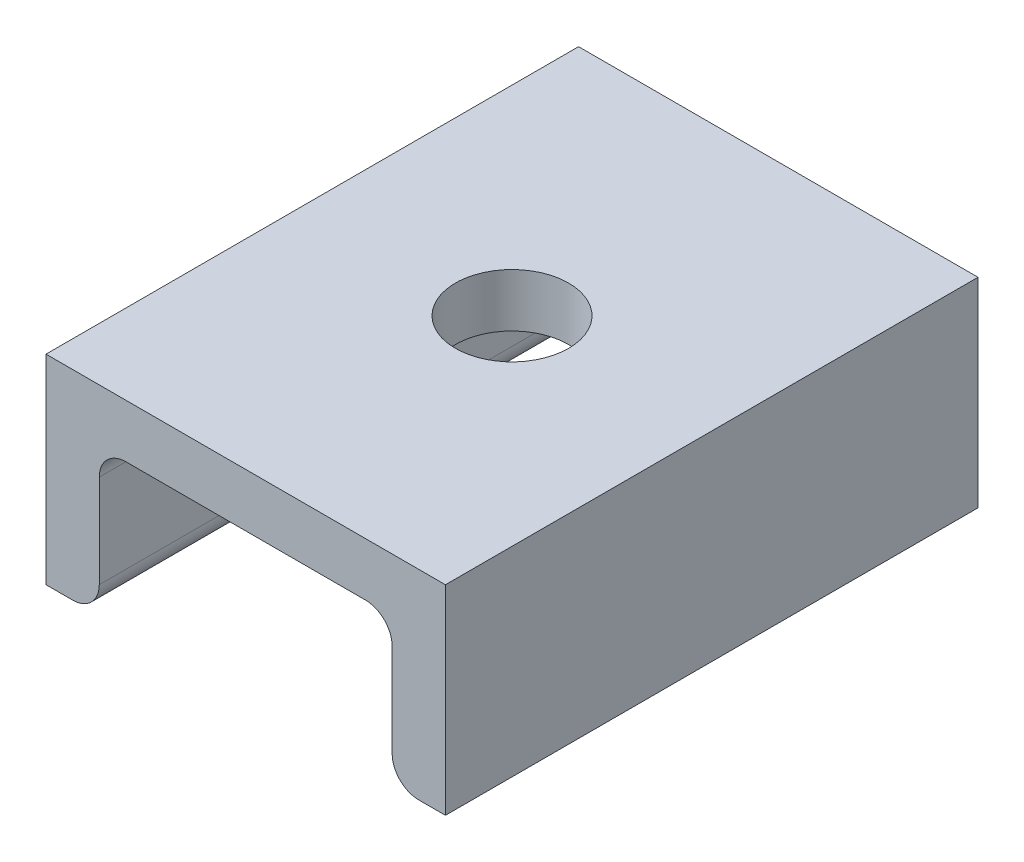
ISO-10303-21;
HEADER;
FILE_DESCRIPTION(('STEP AP214'),'2;1');
FILE_NAME('part.step','',(''),(''),'','','');
FILE_SCHEMA(('AUTOMOTIVE_DESIGN { 1 0 10303 214 1 1 1 1 }'));
ENDSEC;
DATA;
#1=APPLICATION_CONTEXT('core data for automotive mechanical design processes');
#2=APPLICATION_PROTOCOL_DEFINITION('international standard','automotive_design',2000,#1);
#3=PRODUCT_CONTEXT('',#1,'mechanical');
#4=PRODUCT('Part','Part','',(#3));
#5=PRODUCT_RELATED_PRODUCT_CATEGORY('part','',(#4));
#6=PRODUCT_DEFINITION_FORMATION('','',#4);
#7=PRODUCT_DEFINITION_CONTEXT('part definition',#1,'design');
#8=PRODUCT_DEFINITION('design','',#6,#7);
#9=PRODUCT_DEFINITION_SHAPE('','',#8);
#10=(LENGTH_UNIT() NAMED_UNIT(*) SI_UNIT(.MILLI.,.METRE.));
#11=(NAMED_UNIT(*) PLANE_ANGLE_UNIT() SI_UNIT($,.RADIAN.));
#12=(NAMED_UNIT(*) SI_UNIT($,.STERADIAN.) SOLID_ANGLE_UNIT());
#13=UNCERTAINTY_MEASURE_WITH_UNIT(LENGTH_MEASURE(1.E-05),#10,'distance_accuracy_value','');
#14=(GEOMETRIC_REPRESENTATION_CONTEXT(3) GLOBAL_UNCERTAINTY_ASSIGNED_CONTEXT((#13)) GLOBAL_UNIT_ASSIGNED_CONTEXT((#10,
#11,#12)) REPRESENTATION_CONTEXT('',''));
#15=CARTESIAN_POINT('',(0.,0.,0.));
#16=DIRECTION('',(0.,0.,1.));
#17=DIRECTION('',(1.,0.,0.));
#18=AXIS2_PLACEMENT_3D('',#15,#16,#17);
#19=CARTESIAN_POINT('',(13.,-15.,40.));
#20=DIRECTION('',(0.,1.,0.));
#21=DIRECTION('',(0.,0.,1.));
#22=AXIS2_PLACEMENT_3D('',#19,#20,#21);
#23=PLANE('',#22);
#24=DIRECTION('',(1.,0.,0.));
#25=VECTOR('',#24,1.);
#26=CARTESIAN_POINT('',(13.,-15.,0.));
#27=LINE('',#26,#25);
#28=CARTESIAN_POINT('',(13.,-15.,0.));
#29=VERTEX_POINT('',#28);
#30=CARTESIAN_POINT('',(15.,-15.,0.));
#31=VERTEX_POINT('',#30);
#32=EDGE_CURVE('E155',#29,#31,#27,.T.);
#33=ORIENTED_EDGE('',*,*,#32,.T.);
#34=DIRECTION('',(0.,0.,-1.));
#35=VECTOR('',#34,1.);
#36=CARTESIAN_POINT('',(15.,-15.,40.));
#37=LINE('',#36,#35);
#38=CARTESIAN_POINT('',(15.,-15.,40.));
#39=VERTEX_POINT('',#38);
#40=EDGE_CURVE('E11',#39,#31,#37,.T.);
#41=ORIENTED_EDGE('',*,*,#40,.F.);
#42=DIRECTION('',(1.,0.,0.));
#43=VECTOR('',#42,1.);
#44=CARTESIAN_POINT('',(13.,-15.,40.));
#45=LINE('',#44,#43);
#46=CARTESIAN_POINT('',(13.,-15.,40.));
#47=VERTEX_POINT('',#46);
#48=EDGE_CURVE('E178',#47,#39,#45,.T.);
#49=ORIENTED_EDGE('',*,*,#48,.F.);
#50=DIRECTION('',(0.,0.,-1.));
#51=VECTOR('',#50,1.);
#52=CARTESIAN_POINT('',(13.,-15.,40.));
#53=LINE('',#52,#51);
#54=EDGE_CURVE('E151',#47,#29,#53,.T.);
#55=ORIENTED_EDGE('',*,*,#54,.T.);
#56=EDGE_LOOP('',(#33,#41,#49,#55));
#57=FACE_BOUND('',#56,.T.);
#58=ADVANCED_FACE('F35',(#57),#23,.F.);
#59=CARTESIAN_POINT('',(15.,-15.,40.));
#60=DIRECTION('',(-1.,0.,0.));
#61=DIRECTION('',(0.,-1.,0.));
#62=AXIS2_PLACEMENT_3D('',#59,#60,#61);
#63=PLANE('',#62);
#64=DIRECTION('',(0.,1.,0.));
#65=VECTOR('',#64,1.);
#66=CARTESIAN_POINT('',(15.,-15.,0.));
#67=LINE('',#66,#65);
#68=CARTESIAN_POINT('',(15.,0.,0.));
#69=VERTEX_POINT('',#68);
#70=EDGE_CURVE('E158',#31,#69,#67,.T.);
#71=ORIENTED_EDGE('',*,*,#70,.T.);
#72=DIRECTION('',(0.,0.,-1.));
#73=VECTOR('',#72,1.);
#74=CARTESIAN_POINT('',(15.,0.,40.));
#75=LINE('',#74,#73);
#76=CARTESIAN_POINT('',(15.,0.,40.));
#77=VERTEX_POINT('',#76);
#78=EDGE_CURVE('E43',#77,#69,#75,.T.);
#79=ORIENTED_EDGE('',*,*,#78,.F.);
#80=DIRECTION('',(0.,1.,0.));
#81=VECTOR('',#80,1.);
#82=CARTESIAN_POINT('',(15.,-15.,40.));
#83=LINE('',#82,#81);
#84=EDGE_CURVE('E106',#39,#77,#83,.T.);
#85=ORIENTED_EDGE('',*,*,#84,.F.);
#86=ORIENTED_EDGE('',*,*,#40,.T.);
#87=EDGE_LOOP('',(#71,#79,#85,#86));
#88=FACE_BOUND('',#87,.T.);
#89=ADVANCED_FACE('F256',(#88),#63,.F.);
#90=CARTESIAN_POINT('',(15.,0.,40.));
#91=DIRECTION('',(0.,-1.,0.));
#92=DIRECTION('',(1.,0.,0.));
#93=AXIS2_PLACEMENT_3D('',#90,#91,#92);
#94=PLANE('',#93);
#95=CARTESIAN_POINT('',(0.,0.,20.));
#96=DIRECTION('',(0.,-1.,0.));
#97=DIRECTION('',(1.,0.,0.));
#98=AXIS2_PLACEMENT_3D('',#95,#96,#97);
#99=CIRCLE('',#98,4.25);
#100=CARTESIAN_POINT('',(4.25,0.,20.));
#101=VERTEX_POINT('',#100);
#102=EDGE_CURVE('E159',#101,#101,#99,.T.);
#103=ORIENTED_EDGE('',*,*,#102,.T.);
#104=EDGE_LOOP('',(#103));
#105=FACE_BOUND('',#104,.T.);
#106=DIRECTION('',(-1.,0.,0.));
#107=VECTOR('',#106,1.);
#108=CARTESIAN_POINT('',(15.,0.,0.));
#109=LINE('',#108,#107);
#110=CARTESIAN_POINT('',(-15.,0.,0.));
#111=VERTEX_POINT('',#110);
#112=EDGE_CURVE('E161',#69,#111,#109,.T.);
#113=ORIENTED_EDGE('',*,*,#112,.T.);
#114=DIRECTION('',(0.,0.,-1.));
#115=VECTOR('',#114,1.);
#116=CARTESIAN_POINT('',(-15.,0.,40.));
#117=LINE('',#116,#115);
#118=CARTESIAN_POINT('',(-15.,0.,40.));
#119=VERTEX_POINT('',#118);
#120=EDGE_CURVE('E197',#119,#111,#117,.T.);
#121=ORIENTED_EDGE('',*,*,#120,.F.);
#122=DIRECTION('',(-1.,0.,0.));
#123=VECTOR('',#122,1.);
#124=CARTESIAN_POINT('',(15.,0.,40.));
#125=LINE('',#124,#123);
#126=EDGE_CURVE('E205',#77,#119,#125,.T.);
#127=ORIENTED_EDGE('',*,*,#126,.F.);
#128=ORIENTED_EDGE('',*,*,#78,.T.);
#129=EDGE_LOOP('',(#113,#121,#127,#128));
#130=FACE_BOUND('',#129,.T.);
#131=ADVANCED_FACE('F203',(#105,#130),#94,.F.);
#132=CARTESIAN_POINT('',(-15.,-15.,40.));
#133=DIRECTION('',(1.,0.,0.));
#134=DIRECTION('',(0.,1.,0.));
#135=AXIS2_PLACEMENT_3D('',#132,#133,#134);
#136=PLANE('',#135);
#137=DIRECTION('',(0.,-1.,0.));
#138=VECTOR('',#137,1.);
#139=CARTESIAN_POINT('',(-15.,-15.,0.));
#140=LINE('',#139,#138);
#141=CARTESIAN_POINT('',(-15.,-15.,0.));
#142=VERTEX_POINT('',#141);
#143=EDGE_CURVE('E163',#111,#142,#140,.T.);
#144=ORIENTED_EDGE('',*,*,#143,.T.);
#145=DIRECTION('',(0.,0.,-1.));
#146=VECTOR('',#145,1.);
#147=CARTESIAN_POINT('',(-15.,-15.,40.));
#148=LINE('',#147,#146);
#149=CARTESIAN_POINT('',(-15.,-15.,40.));
#150=VERTEX_POINT('',#149);
#151=EDGE_CURVE('E194',#150,#142,#148,.T.);
#152=ORIENTED_EDGE('',*,*,#151,.F.);
#153=DIRECTION('',(0.,-1.,0.));
#154=VECTOR('',#153,1.);
#155=CARTESIAN_POINT('',(-15.,-15.,40.));
#156=LINE('',#155,#154);
#157=EDGE_CURVE('E223',#119,#150,#156,.T.);
#158=ORIENTED_EDGE('',*,*,#157,.F.);
#159=ORIENTED_EDGE('',*,*,#120,.T.);
#160=EDGE_LOOP('',(#144,#152,#158,#159));
#161=FACE_BOUND('',#160,.T.);
#162=ADVANCED_FACE('F214',(#161),#136,.F.);
#163=CARTESIAN_POINT('',(-13.,-15.,40.));
#164=DIRECTION('',(0.,1.,0.));
#165=DIRECTION('',(0.,0.,1.));
#166=AXIS2_PLACEMENT_3D('',#163,#164,#165);
#167=PLANE('',#166);
#168=DIRECTION('',(1.,0.,0.));
#169=VECTOR('',#168,1.);
#170=CARTESIAN_POINT('',(-13.,-15.,0.));
#171=LINE('',#170,#169);
#172=CARTESIAN_POINT('',(-13.,-15.,0.));
#173=VERTEX_POINT('',#172);
#174=EDGE_CURVE('E165',#142,#173,#171,.T.);
#175=ORIENTED_EDGE('',*,*,#174,.T.);
#176=DIRECTION('',(0.,0.,-1.));
#177=VECTOR('',#176,1.);
#178=CARTESIAN_POINT('',(-13.,-15.,40.));
#179=LINE('',#178,#177);
#180=CARTESIAN_POINT('',(-13.,-15.,40.));
#181=VERTEX_POINT('',#180);
#182=EDGE_CURVE('E191',#181,#173,#179,.T.);
#183=ORIENTED_EDGE('',*,*,#182,.F.);
#184=DIRECTION('',(1.,0.,0.));
#185=VECTOR('',#184,1.);
#186=CARTESIAN_POINT('',(-13.,-15.,40.));
#187=LINE('',#186,#185);
#188=EDGE_CURVE('E220',#150,#181,#187,.T.);
#189=ORIENTED_EDGE('',*,*,#188,.F.);
#190=ORIENTED_EDGE('',*,*,#151,.T.);
#191=EDGE_LOOP('',(#175,#183,#189,#190));
#192=FACE_BOUND('',#191,.T.);
#193=ADVANCED_FACE('F218',(#192),#167,.F.);
#194=CARTESIAN_POINT('',(-13.,-13.,40.));
#195=DIRECTION('',(0.,0.,-1.));
#196=DIRECTION('',(-1.,0.,0.));
#197=AXIS2_PLACEMENT_3D('',#194,#195,#196);
#198=CYLINDRICAL_SURFACE('',#197,2.);
#199=CARTESIAN_POINT('',(-13.,-13.,0.));
#200=DIRECTION('',(0.,0.,1.));
#201=DIRECTION('',(-1.,0.,0.));
#202=AXIS2_PLACEMENT_3D('',#199,#200,#201);
#203=CIRCLE('',#202,2.);
#204=CARTESIAN_POINT('',(-11.,-13.,0.));
#205=VERTEX_POINT('',#204);
#206=EDGE_CURVE('E167',#173,#205,#203,.T.);
#207=ORIENTED_EDGE('',*,*,#206,.T.);
#208=DIRECTION('',(0.,0.,-1.));
#209=VECTOR('',#208,1.);
#210=CARTESIAN_POINT('',(-11.,-13.,40.));
#211=LINE('',#210,#209);
#212=CARTESIAN_POINT('',(-11.,-13.,40.));
#213=VERTEX_POINT('',#212);
#214=EDGE_CURVE('E188',#213,#205,#211,.T.);
#215=ORIENTED_EDGE('',*,*,#214,.F.);
#216=CARTESIAN_POINT('',(-13.,-13.,40.));
#217=DIRECTION('',(0.,0.,1.));
#218=DIRECTION('',(-1.,0.,0.));
#219=AXIS2_PLACEMENT_3D('',#216,#217,#218);
#220=CIRCLE('',#219,2.);
#221=EDGE_CURVE('E222',#181,#213,#220,.T.);
#222=ORIENTED_EDGE('',*,*,#221,.F.);
#223=ORIENTED_EDGE('',*,*,#182,.T.);
#224=EDGE_LOOP('',(#207,#215,#222,#223));
#225=FACE_BOUND('',#224,.T.);
#226=ADVANCED_FACE('F270',(#225),#198,.T.);
#227=CARTESIAN_POINT('',(-11.,-6.,40.));
#228=DIRECTION('',(-1.,0.,0.));
#229=DIRECTION('',(0.,0.,1.));
#230=AXIS2_PLACEMENT_3D('',#227,#228,#229);
#231=PLANE('',#230);
#232=DIRECTION('',(0.,1.,0.));
#233=VECTOR('',#232,1.);
#234=CARTESIAN_POINT('',(-11.,-6.,0.));
#235=LINE('',#234,#233);
#236=CARTESIAN_POINT('',(-11.,-6.,0.));
#237=VERTEX_POINT('',#236);
#238=EDGE_CURVE('E169',#205,#237,#235,.T.);
#239=ORIENTED_EDGE('',*,*,#238,.T.);
#240=DIRECTION('',(0.,0.,-1.));
#241=VECTOR('',#240,1.);
#242=CARTESIAN_POINT('',(-11.,-6.,40.));
#243=LINE('',#242,#241);
#244=CARTESIAN_POINT('',(-11.,-6.,40.));
#245=VERTEX_POINT('',#244);
#246=EDGE_CURVE('E185',#245,#237,#243,.T.);
#247=ORIENTED_EDGE('',*,*,#246,.F.);
#248=DIRECTION('',(0.,1.,0.));
#249=VECTOR('',#248,1.);
#250=CARTESIAN_POINT('',(-11.,-6.,40.));
#251=LINE('',#250,#249);
#252=EDGE_CURVE('E225',#213,#245,#251,.T.);
#253=ORIENTED_EDGE('',*,*,#252,.F.);
#254=ORIENTED_EDGE('',*,*,#214,.T.);
#255=EDGE_LOOP('',(#239,#247,#253,#254));
#256=FACE_BOUND('',#255,.T.);
#257=ADVANCED_FACE('F273',(#256),#231,.F.);
#258=CARTESIAN_POINT('',(-9.,-6.,40.));
#259=DIRECTION('',(0.,0.,-1.));
#260=DIRECTION('',(-1.,0.,0.));
#261=AXIS2_PLACEMENT_3D('',#258,#259,#260);
#262=CYLINDRICAL_SURFACE('',#261,2.);
#263=CARTESIAN_POINT('',(-9.,-6.,0.));
#264=DIRECTION('',(0.,0.,-1.));
#265=DIRECTION('',(1.,0.,0.));
#266=AXIS2_PLACEMENT_3D('',#263,#264,#265);
#267=CIRCLE('',#266,2.);
#268=CARTESIAN_POINT('',(-9.,-4.,0.));
#269=VERTEX_POINT('',#268);
#270=EDGE_CURVE('E171',#237,#269,#267,.T.);
#271=ORIENTED_EDGE('',*,*,#270,.T.);
#272=DIRECTION('',(0.,0.,-1.));
#273=VECTOR('',#272,1.);
#274=CARTESIAN_POINT('',(-9.,-4.,40.));
#275=LINE('',#274,#273);
#276=CARTESIAN_POINT('',(-9.,-4.,40.));
#277=VERTEX_POINT('',#276);
#278=EDGE_CURVE('E182',#277,#269,#275,.T.);
#279=ORIENTED_EDGE('',*,*,#278,.F.);
#280=CARTESIAN_POINT('',(-9.,-6.,40.));
#281=DIRECTION('',(0.,0.,-1.));
#282=DIRECTION('',(1.,0.,0.));
#283=AXIS2_PLACEMENT_3D('',#280,#281,#282);
#284=CIRCLE('',#283,2.);
#285=EDGE_CURVE('E231',#245,#277,#284,.T.);
#286=ORIENTED_EDGE('',*,*,#285,.F.);
#287=ORIENTED_EDGE('',*,*,#246,.T.);
#288=EDGE_LOOP('',(#271,#279,#286,#287));
#289=FACE_BOUND('',#288,.T.);
#290=ADVANCED_FACE('F237',(#289),#262,.F.);
#291=CARTESIAN_POINT('',(-9.,-4.,40.));
#292=DIRECTION('',(0.,1.,0.));
#293=DIRECTION('',(-1.,0.,0.));
#294=AXIS2_PLACEMENT_3D('',#291,#292,#293);
#295=PLANE('',#294);
#296=CARTESIAN_POINT('',(0.,-4.,20.));
#297=DIRECTION('',(0.,-1.,0.));
#298=DIRECTION('',(1.,0.,0.));
#299=AXIS2_PLACEMENT_3D('',#296,#297,#298);
#300=CIRCLE('',#299,4.25);
#301=CARTESIAN_POINT('',(4.25,-4.,20.));
#302=VERTEX_POINT('',#301);
#303=EDGE_CURVE('E342',#302,#302,#300,.T.);
#304=ORIENTED_EDGE('',*,*,#303,.F.);
#305=EDGE_LOOP('',(#304));
#306=FACE_BOUND('',#305,.T.);
#307=DIRECTION('',(1.,0.,0.));
#308=VECTOR('',#307,1.);
#309=CARTESIAN_POINT('',(-9.,-4.,0.));
#310=LINE('',#309,#308);
#311=CARTESIAN_POINT('',(9.,-4.,0.));
#312=VERTEX_POINT('',#311);
#313=EDGE_CURVE('E173',#269,#312,#310,.T.);
#314=ORIENTED_EDGE('',*,*,#313,.T.);
#315=DIRECTION('',(0.,0.,-1.));
#316=VECTOR('',#315,1.);
#317=CARTESIAN_POINT('',(9.,-4.,40.));
#318=LINE('',#317,#316);
#319=CARTESIAN_POINT('',(9.,-4.,40.));
#320=VERTEX_POINT('',#319);
#321=EDGE_CURVE('E146',#320,#312,#318,.T.);
#322=ORIENTED_EDGE('',*,*,#321,.F.);
#323=DIRECTION('',(1.,0.,0.));
#324=VECTOR('',#323,1.);
#325=CARTESIAN_POINT('',(-9.,-4.,40.));
#326=LINE('',#325,#324);
#327=EDGE_CURVE('E137',#277,#320,#326,.T.);
#328=ORIENTED_EDGE('',*,*,#327,.F.);
#329=ORIENTED_EDGE('',*,*,#278,.T.);
#330=EDGE_LOOP('',(#314,#322,#328,#329));
#331=FACE_BOUND('',#330,.T.);
#332=ADVANCED_FACE('F241',(#306,#331),#295,.F.);
#333=CARTESIAN_POINT('',(9.,-6.,40.));
#334=DIRECTION('',(0.,0.,-1.));
#335=DIRECTION('',(-1.,0.,0.));
#336=AXIS2_PLACEMENT_3D('',#333,#334,#335);
#337=CYLINDRICAL_SURFACE('',#336,2.);
#338=CARTESIAN_POINT('',(9.,-6.,0.));
#339=DIRECTION('',(0.,0.,-1.));
#340=DIRECTION('',(-1.,0.,0.));
#341=AXIS2_PLACEMENT_3D('',#338,#339,#340);
#342=CIRCLE('',#341,2.);
#343=CARTESIAN_POINT('',(11.,-6.,0.));
#344=VERTEX_POINT('',#343);
#345=EDGE_CURVE('E145',#312,#344,#342,.T.);
#346=ORIENTED_EDGE('',*,*,#345,.T.);
#347=DIRECTION('',(0.,0.,-1.));
#348=VECTOR('',#347,1.);
#349=CARTESIAN_POINT('',(11.,-6.,40.));
#350=LINE('',#349,#348);
#351=CARTESIAN_POINT('',(11.,-6.,40.));
#352=VERTEX_POINT('',#351);
#353=EDGE_CURVE('E142',#352,#344,#350,.T.);
#354=ORIENTED_EDGE('',*,*,#353,.F.);
#355=CARTESIAN_POINT('',(9.,-6.,40.));
#356=DIRECTION('',(0.,0.,-1.));
#357=DIRECTION('',(-1.,0.,0.));
#358=AXIS2_PLACEMENT_3D('',#355,#356,#357);
#359=CIRCLE('',#358,2.);
#360=EDGE_CURVE('E131',#320,#352,#359,.T.);
#361=ORIENTED_EDGE('',*,*,#360,.F.);
#362=ORIENTED_EDGE('',*,*,#321,.T.);
#363=EDGE_LOOP('',(#346,#354,#361,#362));
#364=FACE_BOUND('',#363,.T.);
#365=ADVANCED_FACE('F143',(#364),#337,.F.);
#366=CARTESIAN_POINT('',(11.,-6.,40.));
#367=DIRECTION('',(1.,0.,0.));
#368=DIRECTION('',(0.,0.,-1.));
#369=AXIS2_PLACEMENT_3D('',#366,#367,#368);
#370=PLANE('',#369);
#371=DIRECTION('',(0.,-1.,0.));
#372=VECTOR('',#371,1.);
#373=CARTESIAN_POINT('',(11.,-6.,0.));
#374=LINE('',#373,#372);
#375=CARTESIAN_POINT('',(11.,-13.,0.));
#376=VERTEX_POINT('',#375);
#377=EDGE_CURVE('E92',#344,#376,#374,.T.);
#378=ORIENTED_EDGE('',*,*,#377,.T.);
#379=DIRECTION('',(0.,0.,-1.));
#380=VECTOR('',#379,1.);
#381=CARTESIAN_POINT('',(11.,-13.,40.));
#382=LINE('',#381,#380);
#383=CARTESIAN_POINT('',(11.,-13.,40.));
#384=VERTEX_POINT('',#383);
#385=EDGE_CURVE('E147',#384,#376,#382,.T.);
#386=ORIENTED_EDGE('',*,*,#385,.F.);
#387=DIRECTION('',(0.,-1.,0.));
#388=VECTOR('',#387,1.);
#389=CARTESIAN_POINT('',(11.,-6.,40.));
#390=LINE('',#389,#388);
#391=EDGE_CURVE('E135',#352,#384,#390,.T.);
#392=ORIENTED_EDGE('',*,*,#391,.F.);
#393=ORIENTED_EDGE('',*,*,#353,.T.);
#394=EDGE_LOOP('',(#378,#386,#392,#393));
#395=FACE_BOUND('',#394,.T.);
#396=ADVANCED_FACE('F149',(#395),#370,.F.);
#397=CARTESIAN_POINT('',(13.,-13.,40.));
#398=DIRECTION('',(0.,0.,-1.));
#399=DIRECTION('',(-1.,0.,0.));
#400=AXIS2_PLACEMENT_3D('',#397,#398,#399);
#401=CYLINDRICAL_SURFACE('',#400,2.);
#402=CARTESIAN_POINT('',(13.,-13.,0.));
#403=DIRECTION('',(0.,0.,1.));
#404=DIRECTION('',(1.,0.,0.));
#405=AXIS2_PLACEMENT_3D('',#402,#403,#404);
#406=CIRCLE('',#405,2.);
#407=EDGE_CURVE('E98',#376,#29,#406,.T.);
#408=ORIENTED_EDGE('',*,*,#407,.T.);
#409=ORIENTED_EDGE('',*,*,#54,.F.);
#410=CARTESIAN_POINT('',(13.,-13.,40.));
#411=DIRECTION('',(0.,0.,1.));
#412=DIRECTION('',(1.,0.,0.));
#413=AXIS2_PLACEMENT_3D('',#410,#411,#412);
#414=CIRCLE('',#413,2.);
#415=EDGE_CURVE('E51',#384,#47,#414,.T.);
#416=ORIENTED_EDGE('',*,*,#415,.F.);
#417=ORIENTED_EDGE('',*,*,#385,.T.);
#418=EDGE_LOOP('',(#408,#409,#416,#417));
#419=FACE_BOUND('',#418,.T.);
#420=ADVANCED_FACE('F245',(#419),#401,.T.);
#421=CARTESIAN_POINT('',(-13.,-13.,40.));
#422=DIRECTION('',(0.,0.,-1.));
#423=DIRECTION('',(-1.,0.,0.));
#424=AXIS2_PLACEMENT_3D('',#421,#422,#423);
#425=PLANE('',#424);
#426=ORIENTED_EDGE('',*,*,#48,.T.);
#427=ORIENTED_EDGE('',*,*,#84,.T.);
#428=ORIENTED_EDGE('',*,*,#126,.T.);
#429=ORIENTED_EDGE('',*,*,#157,.T.);
#430=ORIENTED_EDGE('',*,*,#188,.T.);
#431=ORIENTED_EDGE('',*,*,#221,.T.);
#432=ORIENTED_EDGE('',*,*,#252,.T.);
#433=ORIENTED_EDGE('',*,*,#285,.T.);
#434=ORIENTED_EDGE('',*,*,#327,.T.);
#435=ORIENTED_EDGE('',*,*,#360,.T.);
#436=ORIENTED_EDGE('',*,*,#391,.T.);
#437=ORIENTED_EDGE('',*,*,#415,.T.);
#438=EDGE_LOOP('',(#426,#427,#428,#429,#430,#431,#432,#433,#434,#435,#436,#437));
#439=FACE_BOUND('',#438,.T.);
#440=ADVANCED_FACE('F133',(#439),#425,.F.);
#441=CARTESIAN_POINT('',(-13.,-13.,0.));
#442=DIRECTION('',(0.,0.,-1.));
#443=DIRECTION('',(-1.,0.,0.));
#444=AXIS2_PLACEMENT_3D('',#441,#442,#443);
#445=PLANE('',#444);
#446=ORIENTED_EDGE('',*,*,#32,.F.);
#447=ORIENTED_EDGE('',*,*,#407,.F.);
#448=ORIENTED_EDGE('',*,*,#377,.F.);
#449=ORIENTED_EDGE('',*,*,#345,.F.);
#450=ORIENTED_EDGE('',*,*,#313,.F.);
#451=ORIENTED_EDGE('',*,*,#270,.F.);
#452=ORIENTED_EDGE('',*,*,#238,.F.);
#453=ORIENTED_EDGE('',*,*,#206,.F.);
#454=ORIENTED_EDGE('',*,*,#174,.F.);
#455=ORIENTED_EDGE('',*,*,#143,.F.);
#456=ORIENTED_EDGE('',*,*,#112,.F.);
#457=ORIENTED_EDGE('',*,*,#70,.F.);
#458=EDGE_LOOP('',(#446,#447,#448,#449,#450,#451,#452,#453,#454,#455,#456,#457));
#459=FACE_BOUND('',#458,.T.);
#460=ADVANCED_FACE('F209',(#459),#445,.T.);
#461=CARTESIAN_POINT('',(0.,0.,20.));
#462=DIRECTION('',(0.,-1.,0.));
#463=DIRECTION('',(1.,0.,0.));
#464=AXIS2_PLACEMENT_3D('',#461,#462,#463);
#465=CYLINDRICAL_SURFACE('',#464,4.25);
#466=ORIENTED_EDGE('',*,*,#102,.F.);
#467=EDGE_LOOP('',(#466));
#468=FACE_BOUND('',#467,.T.);
#469=ORIENTED_EDGE('',*,*,#303,.T.);
#470=EDGE_LOOP('',(#469));
#471=FACE_BOUND('',#470,.T.);
#472=ADVANCED_FACE('F312',(#468,#471),#465,.F.);
#473=CLOSED_SHELL('',(#58,#89,#131,#162,#193,#226,#257,#290,#332,#365,#396,#420,#440,#460,#472));
#474=MANIFOLD_SOLID_BREP('B2',#473);
#475=ADVANCED_BREP_SHAPE_REPRESENTATION('',(#18,#474),#14);
#476=SHAPE_DEFINITION_REPRESENTATION(#9,#475);
ENDSEC;
END-ISO-10303-21;
